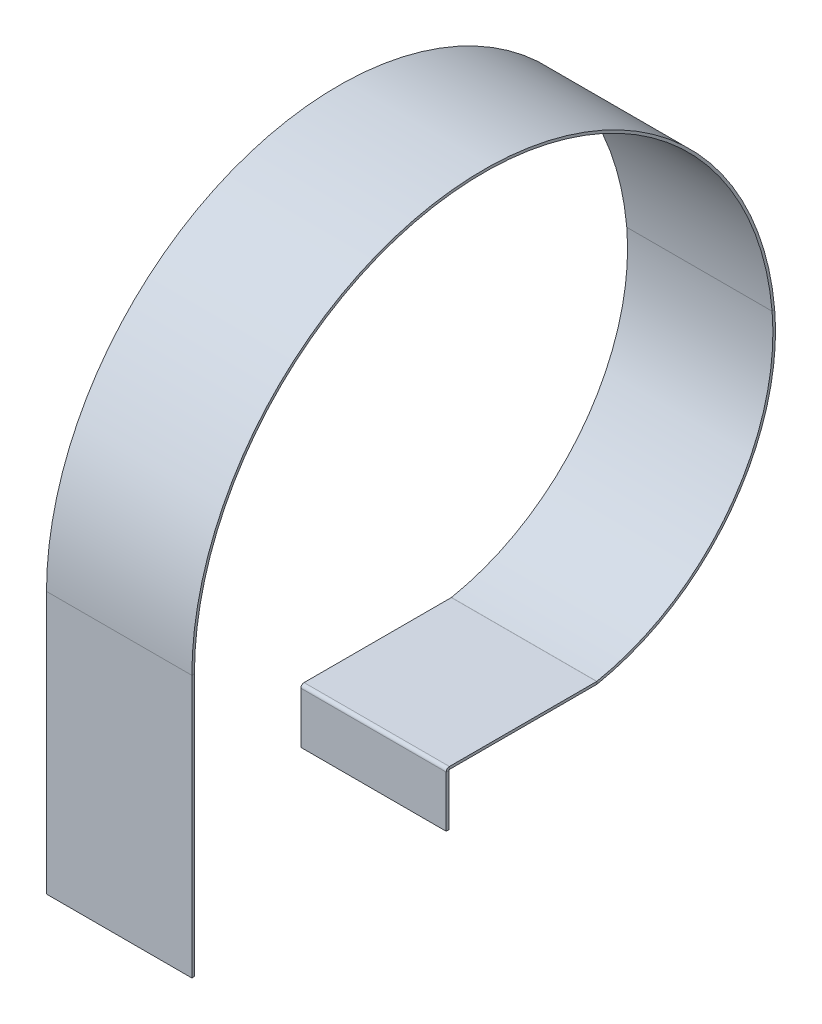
ISO-10303-21;
HEADER;
FILE_DESCRIPTION(('STEP AP214'),'2;1');
FILE_NAME('part.step','',(''),(''),'','','');
FILE_SCHEMA(('AUTOMOTIVE_DESIGN { 1 0 10303 214 1 1 1 1 }'));
ENDSEC;
DATA;
#1=APPLICATION_CONTEXT('core data for automotive mechanical design processes');
#2=APPLICATION_PROTOCOL_DEFINITION('international standard','automotive_design',2000,#1);
#3=PRODUCT_CONTEXT('',#1,'mechanical');
#4=PRODUCT('Part','Part','',(#3));
#5=PRODUCT_RELATED_PRODUCT_CATEGORY('part','',(#4));
#6=PRODUCT_DEFINITION_FORMATION('','',#4);
#7=PRODUCT_DEFINITION_CONTEXT('part definition',#1,'design');
#8=PRODUCT_DEFINITION('design','',#6,#7);
#9=PRODUCT_DEFINITION_SHAPE('','',#8);
#10=(LENGTH_UNIT() NAMED_UNIT(*) SI_UNIT(.MILLI.,.METRE.));
#11=(NAMED_UNIT(*) PLANE_ANGLE_UNIT() SI_UNIT($,.RADIAN.));
#12=(NAMED_UNIT(*) SI_UNIT($,.STERADIAN.) SOLID_ANGLE_UNIT());
#13=UNCERTAINTY_MEASURE_WITH_UNIT(LENGTH_MEASURE(1.E-05),#10,'distance_accuracy_value','');
#14=(GEOMETRIC_REPRESENTATION_CONTEXT(3) GLOBAL_UNCERTAINTY_ASSIGNED_CONTEXT((#13)) GLOBAL_UNIT_ASSIGNED_CONTEXT((#10,
#11,#12)) REPRESENTATION_CONTEXT('',''));
#15=CARTESIAN_POINT('',(0.,0.,0.));
#16=DIRECTION('',(0.,0.,1.));
#17=DIRECTION('',(1.,0.,0.));
#18=AXIS2_PLACEMENT_3D('',#15,#16,#17);
#19=CARTESIAN_POINT('',(112.,41.926268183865,-312.082722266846));
#20=DIRECTION('',(1.,0.,0.));
#21=DIRECTION('',(0.,0.,-1.));
#22=AXIS2_PLACEMENT_3D('',#19,#20,#21);
#23=PLANE('',#22);
#24=DIRECTION('',(0.,0.,1.));
#25=VECTOR('',#24,1.);
#26=CARTESIAN_POINT('',(112.,39.9169446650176,-312.228237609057));
#27=LINE('',#26,#25);
#28=CARTESIAN_POINT('',(112.,39.9169446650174,-311.986615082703));
#29=VERTEX_POINT('',#28);
#30=CARTESIAN_POINT('',(112.,39.9169446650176,-198.498237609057));
#31=VERTEX_POINT('',#30);
#32=EDGE_CURVE('E271',#29,#31,#27,.T.);
#33=ORIENTED_EDGE('',*,*,#32,.F.);
#34=DIRECTION('',(0.,1.,0.));
#35=VECTOR('',#34,1.);
#36=CARTESIAN_POINT('',(112.,39.9169446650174,-311.986615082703));
#37=LINE('',#36,#35);
#38=CARTESIAN_POINT('',(112.,41.9169446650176,-311.986615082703));
#39=VERTEX_POINT('',#38);
#40=EDGE_CURVE('E301',#29,#39,#37,.T.);
#41=ORIENTED_EDGE('',*,*,#40,.T.);
#42=DIRECTION('',(0.,0.,1.));
#43=VECTOR('',#42,1.);
#44=CARTESIAN_POINT('',(112.,41.9169446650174,-312.228237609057));
#45=LINE('',#44,#43);
#46=CARTESIAN_POINT('',(112.,41.9169446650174,-198.498237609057));
#47=VERTEX_POINT('',#46);
#48=EDGE_CURVE('E274',#39,#47,#45,.T.);
#49=ORIENTED_EDGE('',*,*,#48,.T.);
#50=DIRECTION('',(0.,-1.,0.));
#51=VECTOR('',#50,1.);
#52=CARTESIAN_POINT('',(112.,41.9169446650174,-198.498237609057));
#53=LINE('',#52,#51);
#54=EDGE_CURVE('E285',#47,#31,#53,.T.);
#55=ORIENTED_EDGE('',*,*,#54,.T.);
#56=EDGE_LOOP('',(#33,#41,#49,#55));
#57=FACE_BOUND('',#56,.T.);
#58=ADVANCED_FACE('F35',(#57),#23,.T.);
#59=CARTESIAN_POINT('',(0.,39.4169446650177,-195.998237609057));
#60=DIRECTION('',(-1.,0.,0.));
#61=DIRECTION('',(0.,0.,1.));
#62=AXIS2_PLACEMENT_3D('',#59,#60,#61);
#63=PLANE('',#62);
#64=DIRECTION('',(0.,0.,1.));
#65=VECTOR('',#64,1.);
#66=CARTESIAN_POINT('',(0.,39.9169446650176,-312.228237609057));
#67=LINE('',#66,#65);
#68=CARTESIAN_POINT('',(0.,39.9169446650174,-311.986615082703));
#69=VERTEX_POINT('',#68);
#70=CARTESIAN_POINT('',(0.,39.9169446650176,-198.498237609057));
#71=VERTEX_POINT('',#70);
#72=EDGE_CURVE('E266',#69,#71,#67,.T.);
#73=ORIENTED_EDGE('',*,*,#72,.T.);
#74=DIRECTION('',(0.,1.,0.));
#75=VECTOR('',#74,1.);
#76=CARTESIAN_POINT('',(0.,39.9169446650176,-198.498237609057));
#77=LINE('',#76,#75);
#78=CARTESIAN_POINT('',(0.,41.9169446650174,-198.498237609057));
#79=VERTEX_POINT('',#78);
#80=EDGE_CURVE('E290',#71,#79,#77,.T.);
#81=ORIENTED_EDGE('',*,*,#80,.T.);
#82=DIRECTION('',(0.,0.,1.));
#83=VECTOR('',#82,1.);
#84=CARTESIAN_POINT('',(0.,41.9169446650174,-312.228237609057));
#85=LINE('',#84,#83);
#86=CARTESIAN_POINT('',(0.,41.9169446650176,-311.986615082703));
#87=VERTEX_POINT('',#86);
#88=EDGE_CURVE('E275',#87,#79,#85,.T.);
#89=ORIENTED_EDGE('',*,*,#88,.F.);
#90=DIRECTION('',(0.,-1.,0.));
#91=VECTOR('',#90,1.);
#92=CARTESIAN_POINT('',(0.,41.9169446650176,-311.986615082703));
#93=LINE('',#92,#91);
#94=EDGE_CURVE('E296',#87,#69,#93,.T.);
#95=ORIENTED_EDGE('',*,*,#94,.T.);
#96=EDGE_LOOP('',(#73,#81,#89,#95));
#97=FACE_BOUND('',#96,.T.);
#98=ADVANCED_FACE('F348',(#97),#63,.T.);
#99=CARTESIAN_POINT('',(112.,39.9169446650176,-312.228237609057));
#100=DIRECTION('',(0.,-1.,0.));
#101=DIRECTION('',(0.,0.,-1.));
#102=AXIS2_PLACEMENT_3D('',#99,#100,#101);
#103=PLANE('',#102);
#104=ORIENTED_EDGE('',*,*,#72,.F.);
#105=DIRECTION('',(-1.,0.,0.));
#106=VECTOR('',#105,1.);
#107=CARTESIAN_POINT('',(112.,39.9169446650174,-311.986615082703));
#108=LINE('',#107,#106);
#109=EDGE_CURVE('E293',#29,#69,#108,.T.);
#110=ORIENTED_EDGE('',*,*,#109,.F.);
#111=ORIENTED_EDGE('',*,*,#32,.T.);
#112=DIRECTION('',(-1.,0.,0.));
#113=VECTOR('',#112,1.);
#114=CARTESIAN_POINT('',(112.,39.9169446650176,-198.498237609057));
#115=LINE('',#114,#113);
#116=EDGE_CURVE('E278',#31,#71,#115,.T.);
#117=ORIENTED_EDGE('',*,*,#116,.T.);
#118=EDGE_LOOP('',(#104,#110,#111,#117));
#119=FACE_BOUND('',#118,.T.);
#120=ADVANCED_FACE('F353',(#119),#103,.T.);
#121=CARTESIAN_POINT('',(112.,41.9169446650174,-312.228237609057));
#122=DIRECTION('',(0.,-1.,0.));
#123=DIRECTION('',(0.,0.,-1.));
#124=AXIS2_PLACEMENT_3D('',#121,#122,#123);
#125=PLANE('',#124);
#126=ORIENTED_EDGE('',*,*,#88,.T.);
#127=DIRECTION('',(-1.,0.,0.));
#128=VECTOR('',#127,1.);
#129=CARTESIAN_POINT('',(112.,41.9169446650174,-198.498237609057));
#130=LINE('',#129,#128);
#131=EDGE_CURVE('E288',#47,#79,#130,.T.);
#132=ORIENTED_EDGE('',*,*,#131,.F.);
#133=ORIENTED_EDGE('',*,*,#48,.F.);
#134=DIRECTION('',(-1.,0.,0.));
#135=VECTOR('',#134,1.);
#136=CARTESIAN_POINT('',(112.,41.9169446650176,-311.986615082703));
#137=LINE('',#136,#135);
#138=EDGE_CURVE('E298',#39,#87,#137,.T.);
#139=ORIENTED_EDGE('',*,*,#138,.T.);
#140=EDGE_LOOP('',(#126,#132,#133,#139));
#141=FACE_BOUND('',#140,.T.);
#142=ADVANCED_FACE('F378',(#141),#125,.F.);
#143=CARTESIAN_POINT('',(112.,39.4169446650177,-198.498237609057));
#144=DIRECTION('',(-1.,0.,0.));
#145=DIRECTION('',(0.,-1.,0.));
#146=AXIS2_PLACEMENT_3D('',#143,#144,#145);
#147=PLANE('',#146);
#148=ORIENTED_EDGE('',*,*,#54,.F.);
#149=CARTESIAN_POINT('',(112.,39.4169446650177,-198.498237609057));
#150=DIRECTION('',(-1.,0.,0.));
#151=DIRECTION('',(0.,-1.,0.));
#152=AXIS2_PLACEMENT_3D('',#149,#150,#151);
#153=CIRCLE('',#152,2.5);
#154=CARTESIAN_POINT('',(112.,39.4169446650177,-195.998237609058));
#155=VERTEX_POINT('',#154);
#156=EDGE_CURVE('E230',#47,#155,#153,.F.);
#157=ORIENTED_EDGE('',*,*,#156,.T.);
#158=DIRECTION('',(0.,0.,1.));
#159=VECTOR('',#158,1.);
#160=CARTESIAN_POINT('',(112.,39.4169446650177,-197.998237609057));
#161=LINE('',#160,#159);
#162=CARTESIAN_POINT('',(112.,39.4169446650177,-197.998237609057));
#163=VERTEX_POINT('',#162);
#164=EDGE_CURVE('E244',#163,#155,#161,.T.);
#165=ORIENTED_EDGE('',*,*,#164,.F.);
#166=CARTESIAN_POINT('',(112.,39.4169446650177,-198.498237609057));
#167=DIRECTION('',(1.,0.,0.));
#168=DIRECTION('',(0.,1.,0.));
#169=AXIS2_PLACEMENT_3D('',#166,#167,#168);
#170=CIRCLE('',#169,0.499999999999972);
#171=EDGE_CURVE('E259',#31,#163,#170,.T.);
#172=ORIENTED_EDGE('',*,*,#171,.F.);
#173=EDGE_LOOP('',(#148,#157,#165,#172));
#174=FACE_BOUND('',#173,.T.);
#175=ADVANCED_FACE('F401',(#174),#147,.F.);
#176=CARTESIAN_POINT('',(0.,39.4169446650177,-198.498237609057));
#177=DIRECTION('',(1.,0.,0.));
#178=DIRECTION('',(0.,0.,1.));
#179=AXIS2_PLACEMENT_3D('',#176,#177,#178);
#180=PLANE('',#179);
#181=DIRECTION('',(0.,0.,-1.));
#182=VECTOR('',#181,1.);
#183=CARTESIAN_POINT('',(0.,39.4169446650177,-195.998237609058));
#184=LINE('',#183,#182);
#185=CARTESIAN_POINT('',(0.,39.4169446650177,-195.998237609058));
#186=VERTEX_POINT('',#185);
#187=CARTESIAN_POINT('',(0.,39.4169446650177,-197.998237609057));
#188=VERTEX_POINT('',#187);
#189=EDGE_CURVE('E234',#186,#188,#184,.T.);
#190=ORIENTED_EDGE('',*,*,#189,.F.);
#191=CARTESIAN_POINT('',(1.11022302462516E-13,39.4169446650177,-198.498237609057));
#192=DIRECTION('',(-1.,0.,0.));
#193=DIRECTION('',(0.,-1.,0.));
#194=AXIS2_PLACEMENT_3D('',#191,#192,#193);
#195=CIRCLE('',#194,2.5);
#196=EDGE_CURVE('E263',#186,#79,#195,.T.);
#197=ORIENTED_EDGE('',*,*,#196,.T.);
#198=ORIENTED_EDGE('',*,*,#80,.F.);
#199=CARTESIAN_POINT('',(0.,39.4169446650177,-198.498237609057));
#200=DIRECTION('',(-1.,0.,0.));
#201=DIRECTION('',(0.,0.,-1.));
#202=AXIS2_PLACEMENT_3D('',#199,#200,#201);
#203=CIRCLE('',#202,0.499999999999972);
#204=EDGE_CURVE('E262',#188,#71,#203,.T.);
#205=ORIENTED_EDGE('',*,*,#204,.F.);
#206=EDGE_LOOP('',(#190,#197,#198,#205));
#207=FACE_BOUND('',#206,.T.);
#208=ADVANCED_FACE('F387',(#207),#180,.F.);
#209=CARTESIAN_POINT('',(168.042633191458,39.4169446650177,-198.498237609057));
#210=DIRECTION('',(-1.,0.,0.));
#211=DIRECTION('',(0.,-1.,0.));
#212=AXIS2_PLACEMENT_3D('',#209,#210,#211);
#213=CYLINDRICAL_SURFACE('',#212,0.5);
#214=ORIENTED_EDGE('',*,*,#204,.T.);
#215=ORIENTED_EDGE('',*,*,#116,.F.);
#216=ORIENTED_EDGE('',*,*,#171,.T.);
#217=DIRECTION('',(-1.,0.,0.));
#218=VECTOR('',#217,1.);
#219=CARTESIAN_POINT('',(112.,39.4169446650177,-197.998237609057));
#220=LINE('',#219,#218);
#221=EDGE_CURVE('E223',#163,#188,#220,.T.);
#222=ORIENTED_EDGE('',*,*,#221,.T.);
#223=EDGE_LOOP('',(#214,#215,#216,#222));
#224=FACE_BOUND('',#223,.T.);
#225=ADVANCED_FACE('F398',(#224),#213,.F.);
#226=CARTESIAN_POINT('',(168.042633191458,39.4169446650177,-198.498237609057));
#227=DIRECTION('',(-1.,0.,0.));
#228=DIRECTION('',(0.,-1.,0.));
#229=AXIS2_PLACEMENT_3D('',#226,#227,#228);
#230=CYLINDRICAL_SURFACE('',#229,2.5);
#231=ORIENTED_EDGE('',*,*,#196,.F.);
#232=DIRECTION('',(-1.,0.,0.));
#233=VECTOR('',#232,1.);
#234=CARTESIAN_POINT('',(112.,39.4169446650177,-195.998237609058));
#235=LINE('',#234,#233);
#236=EDGE_CURVE('E236',#155,#186,#235,.T.);
#237=ORIENTED_EDGE('',*,*,#236,.F.);
#238=ORIENTED_EDGE('',*,*,#156,.F.);
#239=ORIENTED_EDGE('',*,*,#131,.T.);
#240=EDGE_LOOP('',(#231,#237,#238,#239));
#241=FACE_BOUND('',#240,.T.);
#242=ADVANCED_FACE('F383',(#241),#230,.T.);
#243=CARTESIAN_POINT('',(112.,-0.0830553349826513,-197.998237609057));
#244=DIRECTION('',(0.,-1.,0.));
#245=DIRECTION('',(0.,0.,-1.));
#246=AXIS2_PLACEMENT_3D('',#243,#244,#245);
#247=PLANE('',#246);
#248=DIRECTION('',(0.,0.,1.));
#249=VECTOR('',#248,1.);
#250=CARTESIAN_POINT('',(0.,-0.0830553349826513,-197.998237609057));
#251=LINE('',#250,#249);
#252=CARTESIAN_POINT('',(0.,-0.0830553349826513,-197.998237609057));
#253=VERTEX_POINT('',#252);
#254=CARTESIAN_POINT('',(0.,-0.0830553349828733,-195.998237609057));
#255=VERTEX_POINT('',#254);
#256=EDGE_CURVE('E227',#253,#255,#251,.T.);
#257=ORIENTED_EDGE('',*,*,#256,.F.);
#258=DIRECTION('',(-1.,0.,0.));
#259=VECTOR('',#258,1.);
#260=CARTESIAN_POINT('',(112.,-0.0830553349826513,-197.998237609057));
#261=LINE('',#260,#259);
#262=CARTESIAN_POINT('',(112.,-0.0830553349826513,-197.998237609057));
#263=VERTEX_POINT('',#262);
#264=EDGE_CURVE('E247',#263,#253,#261,.T.);
#265=ORIENTED_EDGE('',*,*,#264,.F.);
#266=DIRECTION('',(0.,0.,1.));
#267=VECTOR('',#266,1.);
#268=CARTESIAN_POINT('',(112.,-0.0830553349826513,-197.998237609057));
#269=LINE('',#268,#267);
#270=CARTESIAN_POINT('',(112.,-0.0830553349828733,-195.998237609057));
#271=VERTEX_POINT('',#270);
#272=EDGE_CURVE('E254',#263,#271,#269,.T.);
#273=ORIENTED_EDGE('',*,*,#272,.T.);
#274=DIRECTION('',(-1.,0.,0.));
#275=VECTOR('',#274,1.);
#276=CARTESIAN_POINT('',(112.,-0.0830553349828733,-195.998237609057));
#277=LINE('',#276,#275);
#278=EDGE_CURVE('E252',#271,#255,#277,.T.);
#279=ORIENTED_EDGE('',*,*,#278,.T.);
#280=EDGE_LOOP('',(#257,#265,#273,#279));
#281=FACE_BOUND('',#280,.T.);
#282=ADVANCED_FACE('F409',(#281),#247,.T.);
#283=CARTESIAN_POINT('',(112.,39.9169446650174,-197.998237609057));
#284=DIRECTION('',(0.,0.,-1.));
#285=DIRECTION('',(-1.,0.,0.));
#286=AXIS2_PLACEMENT_3D('',#283,#284,#285);
#287=PLANE('',#286);
#288=DIRECTION('',(0.,-1.,0.));
#289=VECTOR('',#288,1.);
#290=CARTESIAN_POINT('',(0.,39.9169446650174,-197.998237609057));
#291=LINE('',#290,#289);
#292=EDGE_CURVE('E231',#188,#253,#291,.T.);
#293=ORIENTED_EDGE('',*,*,#292,.F.);
#294=ORIENTED_EDGE('',*,*,#221,.F.);
#295=DIRECTION('',(0.,-1.,0.));
#296=VECTOR('',#295,1.);
#297=CARTESIAN_POINT('',(112.,39.9169446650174,-197.998237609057));
#298=LINE('',#297,#296);
#299=EDGE_CURVE('E249',#163,#263,#298,.T.);
#300=ORIENTED_EDGE('',*,*,#299,.T.);
#301=ORIENTED_EDGE('',*,*,#264,.T.);
#302=EDGE_LOOP('',(#293,#294,#300,#301));
#303=FACE_BOUND('',#302,.T.);
#304=ADVANCED_FACE('F394',(#303),#287,.T.);
#305=CARTESIAN_POINT('',(112.,41.9169446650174,-198.498237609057));
#306=DIRECTION('',(1.,0.,0.));
#307=DIRECTION('',(0.,0.,-1.));
#308=AXIS2_PLACEMENT_3D('',#305,#306,#307);
#309=PLANE('',#308);
#310=ORIENTED_EDGE('',*,*,#299,.F.);
#311=ORIENTED_EDGE('',*,*,#164,.T.);
#312=DIRECTION('',(0.,1.,0.));
#313=VECTOR('',#312,1.);
#314=CARTESIAN_POINT('',(112.,39.9169446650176,-195.998237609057));
#315=LINE('',#314,#313);
#316=EDGE_CURVE('E242',#155,#271,#315,.F.);
#317=ORIENTED_EDGE('',*,*,#316,.T.);
#318=ORIENTED_EDGE('',*,*,#272,.F.);
#319=EDGE_LOOP('',(#310,#311,#317,#318));
#320=FACE_BOUND('',#319,.T.);
#321=ADVANCED_FACE('F403',(#320),#309,.T.);
#322=CARTESIAN_POINT('',(112.,39.9169446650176,-195.998237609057));
#323=DIRECTION('',(0.,0.,-1.));
#324=DIRECTION('',(-1.,0.,0.));
#325=AXIS2_PLACEMENT_3D('',#322,#323,#324);
#326=PLANE('',#325);
#327=DIRECTION('',(0.,1.,0.));
#328=VECTOR('',#327,1.);
#329=CARTESIAN_POINT('',(0.,39.9169446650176,-195.998237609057));
#330=LINE('',#329,#328);
#331=EDGE_CURVE('E239',#186,#255,#330,.F.);
#332=ORIENTED_EDGE('',*,*,#331,.T.);
#333=ORIENTED_EDGE('',*,*,#278,.F.);
#334=ORIENTED_EDGE('',*,*,#316,.F.);
#335=ORIENTED_EDGE('',*,*,#236,.T.);
#336=EDGE_LOOP('',(#332,#333,#334,#335));
#337=FACE_BOUND('',#336,.T.);
#338=ADVANCED_FACE('F407',(#337),#326,.F.);
#339=CARTESIAN_POINT('',(0.,39.4169446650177,-198.498237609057));
#340=DIRECTION('',(-1.,0.,0.));
#341=DIRECTION('',(0.,0.,1.));
#342=AXIS2_PLACEMENT_3D('',#339,#340,#341);
#343=PLANE('',#342);
#344=ORIENTED_EDGE('',*,*,#331,.F.);
#345=ORIENTED_EDGE('',*,*,#189,.T.);
#346=ORIENTED_EDGE('',*,*,#292,.T.);
#347=ORIENTED_EDGE('',*,*,#256,.T.);
#348=EDGE_LOOP('',(#344,#345,#346,#347));
#349=FACE_BOUND('',#348,.T.);
#350=ADVANCED_FACE('F391',(#349),#343,.T.);
#351=CARTESIAN_POINT('',(112.,42.4169446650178,-311.986615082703));
#352=DIRECTION('',(1.,0.,0.));
#353=DIRECTION('',(0.,0.981352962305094,0.192214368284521));
#354=AXIS2_PLACEMENT_3D('',#351,#352,#353);
#355=PLANE('',#354);
#356=DIRECTION('',(0.,-0.981352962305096,-0.19221436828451));
#357=VECTOR('',#356,1.);
#358=CARTESIAN_POINT('',(112.,41.926268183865,-312.082722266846));
#359=LINE('',#358,#357);
#360=CARTESIAN_POINT('',(112.,41.926268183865,-312.082722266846));
#361=VERTEX_POINT('',#360);
#362=CARTESIAN_POINT('',(112.,39.9635622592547,-312.467151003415));
#363=VERTEX_POINT('',#362);
#364=EDGE_CURVE('E312',#361,#363,#359,.T.);
#365=ORIENTED_EDGE('',*,*,#364,.F.);
#366=CARTESIAN_POINT('',(112.,42.4169446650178,-311.986615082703));
#367=DIRECTION('',(-1.,0.,0.));
#368=DIRECTION('',(0.,-0.981352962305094,-0.192214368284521));
#369=AXIS2_PLACEMENT_3D('',#366,#367,#368);
#370=CIRCLE('',#369,0.5);
#371=EDGE_CURVE('E214',#361,#39,#370,.T.);
#372=ORIENTED_EDGE('',*,*,#371,.T.);
#373=ORIENTED_EDGE('',*,*,#40,.F.);
#374=CARTESIAN_POINT('',(112.,42.4169446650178,-311.986615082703));
#375=DIRECTION('',(-1.,0.,0.));
#376=DIRECTION('',(0.,-0.981352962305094,-0.192214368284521));
#377=AXIS2_PLACEMENT_3D('',#374,#375,#376);
#378=CIRCLE('',#377,2.5);
#379=EDGE_CURVE('E216',#363,#29,#378,.T.);
#380=ORIENTED_EDGE('',*,*,#379,.F.);
#381=EDGE_LOOP('',(#365,#372,#373,#380));
#382=FACE_BOUND('',#381,.T.);
#383=ADVANCED_FACE('F361',(#382),#355,.T.);
#384=CARTESIAN_POINT('',(0.,42.4169446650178,-311.986615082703));
#385=DIRECTION('',(-1.,0.,0.));
#386=DIRECTION('',(0.,-0.981352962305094,-0.192214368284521));
#387=AXIS2_PLACEMENT_3D('',#384,#385,#386);
#388=PLANE('',#387);
#389=ORIENTED_EDGE('',*,*,#94,.F.);
#390=CARTESIAN_POINT('',(0.,42.4169446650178,-311.986615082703));
#391=DIRECTION('',(-1.,0.,0.));
#392=DIRECTION('',(0.,-0.981352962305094,-0.192214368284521));
#393=AXIS2_PLACEMENT_3D('',#390,#391,#392);
#394=CIRCLE('',#393,0.5);
#395=CARTESIAN_POINT('',(0.,41.926268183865,-312.082722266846));
#396=VERTEX_POINT('',#395);
#397=EDGE_CURVE('E220',#87,#396,#394,.F.);
#398=ORIENTED_EDGE('',*,*,#397,.T.);
#399=DIRECTION('',(0.,0.981352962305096,0.19221436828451));
#400=VECTOR('',#399,1.);
#401=CARTESIAN_POINT('',(0.,39.9635622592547,-312.467151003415));
#402=LINE('',#401,#400);
#403=CARTESIAN_POINT('',(0.,39.9635622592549,-312.467151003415));
#404=VERTEX_POINT('',#403);
#405=EDGE_CURVE('E307',#404,#396,#402,.T.);
#406=ORIENTED_EDGE('',*,*,#405,.F.);
#407=CARTESIAN_POINT('',(0.,42.4169446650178,-311.986615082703));
#408=DIRECTION('',(1.,0.,0.));
#409=DIRECTION('',(0.,0.981352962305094,0.192214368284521));
#410=AXIS2_PLACEMENT_3D('',#407,#408,#409);
#411=CIRCLE('',#410,2.5);
#412=EDGE_CURVE('E219',#69,#404,#411,.T.);
#413=ORIENTED_EDGE('',*,*,#412,.F.);
#414=EDGE_LOOP('',(#389,#398,#406,#413));
#415=FACE_BOUND('',#414,.T.);
#416=ADVANCED_FACE('F373',(#415),#388,.T.);
#417=CARTESIAN_POINT('',(168.018231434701,42.4169446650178,-311.986615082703));
#418=DIRECTION('',(-1.,0.,0.));
#419=DIRECTION('',(0.,-0.981352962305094,-0.192214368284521));
#420=AXIS2_PLACEMENT_3D('',#417,#418,#419);
#421=CYLINDRICAL_SURFACE('',#420,2.5);
#422=ORIENTED_EDGE('',*,*,#412,.T.);
#423=DIRECTION('',(-1.,0.,0.));
#424=VECTOR('',#423,1.);
#425=CARTESIAN_POINT('',(112.,39.9635622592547,-312.467151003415));
#426=LINE('',#425,#424);
#427=EDGE_CURVE('E304',#363,#404,#426,.T.);
#428=ORIENTED_EDGE('',*,*,#427,.F.);
#429=ORIENTED_EDGE('',*,*,#379,.T.);
#430=ORIENTED_EDGE('',*,*,#109,.T.);
#431=EDGE_LOOP('',(#422,#428,#429,#430));
#432=FACE_BOUND('',#431,.T.);
#433=ADVANCED_FACE('F364',(#432),#421,.T.);
#434=CARTESIAN_POINT('',(168.018231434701,42.4169446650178,-311.986615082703));
#435=DIRECTION('',(-1.,0.,0.));
#436=DIRECTION('',(0.,-0.981352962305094,-0.192214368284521));
#437=AXIS2_PLACEMENT_3D('',#434,#435,#436);
#438=CYLINDRICAL_SURFACE('',#437,0.5);
#439=ORIENTED_EDGE('',*,*,#397,.F.);
#440=ORIENTED_EDGE('',*,*,#138,.F.);
#441=ORIENTED_EDGE('',*,*,#371,.F.);
#442=DIRECTION('',(-1.,0.,0.));
#443=VECTOR('',#442,1.);
#444=CARTESIAN_POINT('',(112.,41.926268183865,-312.082722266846));
#445=LINE('',#444,#443);
#446=EDGE_CURVE('E309',#361,#396,#445,.T.);
#447=ORIENTED_EDGE('',*,*,#446,.T.);
#448=EDGE_LOOP('',(#439,#440,#441,#447));
#449=FACE_BOUND('',#448,.T.);
#450=ADVANCED_FACE('F376',(#449),#438,.F.);
#451=CARTESIAN_POINT('',(112.,206.793565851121,-279.790708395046));
#452=DIRECTION('',(1.,0.,0.));
#453=DIRECTION('',(0.,-0.0871557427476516,0.996194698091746));
#454=AXIS2_PLACEMENT_3D('',#451,#452,#453);
#455=PLANE('',#454);
#456=DIRECTION('',(0.,0.0871557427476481,-0.996194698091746));
#457=VECTOR('',#456,1.);
#458=CARTESIAN_POINT('',(112.,221.435730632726,-447.15141767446));
#459=LINE('',#458,#457);
#460=CARTESIAN_POINT('',(112.,221.435730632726,-447.15141767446));
#461=VERTEX_POINT('',#460);
#462=CARTESIAN_POINT('',(112.,221.610042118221,-449.143807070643));
#463=VERTEX_POINT('',#462);
#464=EDGE_CURVE('E11',#461,#463,#459,.T.);
#465=ORIENTED_EDGE('',*,*,#464,.F.);
#466=CARTESIAN_POINT('',(112.,206.793565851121,-279.790708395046));
#467=DIRECTION('',(-1.,0.,0.));
#468=DIRECTION('',(0.,0.0871557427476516,-0.996194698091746));
#469=AXIS2_PLACEMENT_3D('',#466,#467,#468);
#470=CIRCLE('',#469,168.);
#471=EDGE_CURVE('E49',#461,#361,#470,.T.);
#472=ORIENTED_EDGE('',*,*,#471,.T.);
#473=ORIENTED_EDGE('',*,*,#364,.T.);
#474=CARTESIAN_POINT('',(112.,206.793565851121,-279.790708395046));
#475=DIRECTION('',(-1.,0.,0.));
#476=DIRECTION('',(0.,0.0871557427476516,-0.996194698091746));
#477=AXIS2_PLACEMENT_3D('',#474,#475,#476);
#478=CIRCLE('',#477,170.);
#479=EDGE_CURVE('E208',#463,#363,#478,.T.);
#480=ORIENTED_EDGE('',*,*,#479,.F.);
#481=EDGE_LOOP('',(#465,#472,#473,#480));
#482=FACE_BOUND('',#481,.T.);
#483=ADVANCED_FACE('F368',(#482),#455,.T.);
#484=CARTESIAN_POINT('',(0.,206.793565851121,-279.790708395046));
#485=DIRECTION('',(-1.,0.,0.));
#486=DIRECTION('',(0.,0.0871557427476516,-0.996194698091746));
#487=AXIS2_PLACEMENT_3D('',#484,#485,#486);
#488=PLANE('',#487);
#489=ORIENTED_EDGE('',*,*,#405,.T.);
#490=CARTESIAN_POINT('',(0.,206.793565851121,-279.790708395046));
#491=DIRECTION('',(-1.,0.,0.));
#492=DIRECTION('',(0.,0.0871557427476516,-0.996194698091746));
#493=AXIS2_PLACEMENT_3D('',#490,#491,#492);
#494=CIRCLE('',#493,168.);
#495=CARTESIAN_POINT('',(0.,221.435730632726,-447.15141767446));
#496=VERTEX_POINT('',#495);
#497=EDGE_CURVE('E57',#396,#496,#494,.F.);
#498=ORIENTED_EDGE('',*,*,#497,.T.);
#499=DIRECTION('',(0.,-0.0871557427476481,0.996194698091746));
#500=VECTOR('',#499,1.);
#501=CARTESIAN_POINT('',(0.,221.610042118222,-449.143807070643));
#502=LINE('',#501,#500);
#503=CARTESIAN_POINT('',(2.4980018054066E-13,221.610042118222,-449.143807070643));
#504=VERTEX_POINT('',#503);
#505=EDGE_CURVE('E317',#504,#496,#502,.T.);
#506=ORIENTED_EDGE('',*,*,#505,.F.);
#507=CARTESIAN_POINT('',(0.,206.793565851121,-279.790708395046));
#508=DIRECTION('',(1.,0.,0.));
#509=DIRECTION('',(0.,-0.0871557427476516,0.996194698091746));
#510=AXIS2_PLACEMENT_3D('',#507,#508,#509);
#511=CIRCLE('',#510,170.);
#512=EDGE_CURVE('E211',#404,#504,#511,.T.);
#513=ORIENTED_EDGE('',*,*,#512,.F.);
#514=EDGE_LOOP('',(#489,#498,#506,#513));
#515=FACE_BOUND('',#514,.T.);
#516=ADVANCED_FACE('F370',(#515),#488,.T.);
#517=CARTESIAN_POINT('',(327.692109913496,206.793565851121,-279.790708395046));
#518=DIRECTION('',(-1.,0.,0.));
#519=DIRECTION('',(0.,0.0871557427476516,-0.996194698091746));
#520=AXIS2_PLACEMENT_3D('',#517,#518,#519);
#521=CYLINDRICAL_SURFACE('',#520,170.);
#522=ORIENTED_EDGE('',*,*,#512,.T.);
#523=DIRECTION('',(-1.,0.,0.));
#524=VECTOR('',#523,1.);
#525=CARTESIAN_POINT('',(112.,221.610042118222,-449.143807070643));
#526=LINE('',#525,#524);
#527=EDGE_CURVE('E315',#463,#504,#526,.T.);
#528=ORIENTED_EDGE('',*,*,#527,.F.);
#529=ORIENTED_EDGE('',*,*,#479,.T.);
#530=ORIENTED_EDGE('',*,*,#427,.T.);
#531=EDGE_LOOP('',(#522,#528,#529,#530));
#532=FACE_BOUND('',#531,.T.);
#533=ADVANCED_FACE('F344',(#532),#521,.T.);
#534=CARTESIAN_POINT('',(327.692109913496,206.793565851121,-279.790708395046));
#535=DIRECTION('',(-1.,0.,0.));
#536=DIRECTION('',(0.,0.0871557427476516,-0.996194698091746));
#537=AXIS2_PLACEMENT_3D('',#534,#535,#536);
#538=CYLINDRICAL_SURFACE('',#537,168.);
#539=ORIENTED_EDGE('',*,*,#497,.F.);
#540=ORIENTED_EDGE('',*,*,#446,.F.);
#541=ORIENTED_EDGE('',*,*,#471,.F.);
#542=DIRECTION('',(-1.,0.,0.));
#543=VECTOR('',#542,1.);
#544=CARTESIAN_POINT('',(112.,221.435730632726,-447.15141767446));
#545=LINE('',#544,#543);
#546=EDGE_CURVE('E42',#461,#496,#545,.T.);
#547=ORIENTED_EDGE('',*,*,#546,.T.);
#548=EDGE_LOOP('',(#539,#540,#541,#547));
#549=FACE_BOUND('',#548,.T.);
#550=ADVANCED_FACE('F320',(#549),#538,.F.);
#551=CARTESIAN_POINT('',(112.,0.,-2.));
#552=DIRECTION('',(0.,-1.,0.));
#553=DIRECTION('',(0.,0.,-1.));
#554=AXIS2_PLACEMENT_3D('',#551,#552,#553);
#555=PLANE('',#554);
#556=DIRECTION('',(0.,0.,1.));
#557=VECTOR('',#556,1.);
#558=CARTESIAN_POINT('',(0.,0.,-2.));
#559=LINE('',#558,#557);
#560=CARTESIAN_POINT('',(0.,0.,-2.));
#561=VERTEX_POINT('',#560);
#562=CARTESIAN_POINT('',(0.,0.,0.));
#563=VERTEX_POINT('',#562);
#564=EDGE_CURVE('E196',#561,#563,#559,.T.);
#565=ORIENTED_EDGE('',*,*,#564,.F.);
#566=DIRECTION('',(-1.,0.,0.));
#567=VECTOR('',#566,1.);
#568=CARTESIAN_POINT('',(112.,0.,-2.));
#569=LINE('',#568,#567);
#570=CARTESIAN_POINT('',(112.,0.,-2.));
#571=VERTEX_POINT('',#570);
#572=EDGE_CURVE('E186',#571,#561,#569,.T.);
#573=ORIENTED_EDGE('',*,*,#572,.F.);
#574=DIRECTION('',(0.,0.,1.));
#575=VECTOR('',#574,1.);
#576=CARTESIAN_POINT('',(112.,0.,-2.));
#577=LINE('',#576,#575);
#578=CARTESIAN_POINT('',(112.,0.,0.));
#579=VERTEX_POINT('',#578);
#580=EDGE_CURVE('E204',#571,#579,#577,.T.);
#581=ORIENTED_EDGE('',*,*,#580,.T.);
#582=DIRECTION('',(-1.,0.,0.));
#583=VECTOR('',#582,1.);
#584=CARTESIAN_POINT('',(112.,0.,0.));
#585=LINE('',#584,#583);
#586=EDGE_CURVE('E174',#579,#563,#585,.T.);
#587=ORIENTED_EDGE('',*,*,#586,.T.);
#588=EDGE_LOOP('',(#565,#573,#581,#587));
#589=FACE_BOUND('',#588,.T.);
#590=ADVANCED_FACE('F336',(#589),#555,.T.);
#591=CARTESIAN_POINT('',(112.,0.,0.));
#592=DIRECTION('',(0.,0.,1.));
#593=DIRECTION('',(1.,0.,0.));
#594=AXIS2_PLACEMENT_3D('',#591,#592,#593);
#595=PLANE('',#594);
#596=DIRECTION('',(0.,1.,0.));
#597=VECTOR('',#596,1.);
#598=CARTESIAN_POINT('',(0.,0.,0.));
#599=LINE('',#598,#597);
#600=CARTESIAN_POINT('',(2.22044604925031E-13,202.,0.));
#601=VERTEX_POINT('',#600);
#602=EDGE_CURVE('E169',#563,#601,#599,.T.);
#603=ORIENTED_EDGE('',*,*,#602,.F.);
#604=ORIENTED_EDGE('',*,*,#586,.F.);
#605=DIRECTION('',(0.,1.,0.));
#606=VECTOR('',#605,1.);
#607=CARTESIAN_POINT('',(112.,0.,0.));
#608=LINE('',#607,#606);
#609=CARTESIAN_POINT('',(112.,202.,0.));
#610=VERTEX_POINT('',#609);
#611=EDGE_CURVE('E170',#579,#610,#608,.T.);
#612=ORIENTED_EDGE('',*,*,#611,.T.);
#613=DIRECTION('',(-1.,0.,0.));
#614=VECTOR('',#613,1.);
#615=CARTESIAN_POINT('',(112.,202.,0.));
#616=LINE('',#615,#614);
#617=EDGE_CURVE('E162',#610,#601,#616,.T.);
#618=ORIENTED_EDGE('',*,*,#617,.T.);
#619=EDGE_LOOP('',(#603,#604,#612,#618));
#620=FACE_BOUND('',#619,.T.);
#621=ADVANCED_FACE('F173',(#620),#595,.T.);
#622=CARTESIAN_POINT('',(0.,41.9169446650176,-311.986615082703));
#623=DIRECTION('',(-1.,0.,0.));
#624=DIRECTION('',(0.,0.,1.));
#625=AXIS2_PLACEMENT_3D('',#622,#623,#624);
#626=PLANE('',#625);
#627=ORIENTED_EDGE('',*,*,#602,.T.);
#628=DIRECTION('',(0.,0.,-1.));
#629=VECTOR('',#628,1.);
#630=CARTESIAN_POINT('',(0.,202.,0.));
#631=LINE('',#630,#629);
#632=CARTESIAN_POINT('',(0.,202.,-2.));
#633=VERTEX_POINT('',#632);
#634=EDGE_CURVE('E199',#601,#633,#631,.T.);
#635=ORIENTED_EDGE('',*,*,#634,.T.);
#636=DIRECTION('',(0.,1.,0.));
#637=VECTOR('',#636,1.);
#638=CARTESIAN_POINT('',(0.,0.,-2.));
#639=LINE('',#638,#637);
#640=EDGE_CURVE('E193',#561,#633,#639,.T.);
#641=ORIENTED_EDGE('',*,*,#640,.F.);
#642=ORIENTED_EDGE('',*,*,#564,.T.);
#643=EDGE_LOOP('',(#627,#635,#641,#642));
#644=FACE_BOUND('',#643,.T.);
#645=ADVANCED_FACE('F334',(#644),#626,.T.);
#646=CARTESIAN_POINT('',(112.,0.,-2.));
#647=DIRECTION('',(0.,0.,1.));
#648=DIRECTION('',(1.,0.,0.));
#649=AXIS2_PLACEMENT_3D('',#646,#647,#648);
#650=PLANE('',#649);
#651=ORIENTED_EDGE('',*,*,#640,.T.);
#652=DIRECTION('',(-1.,0.,0.));
#653=VECTOR('',#652,1.);
#654=CARTESIAN_POINT('',(112.,202.,-2.));
#655=LINE('',#654,#653);
#656=CARTESIAN_POINT('',(112.,202.,-2.));
#657=VERTEX_POINT('',#656);
#658=EDGE_CURVE('E206',#657,#633,#655,.T.);
#659=ORIENTED_EDGE('',*,*,#658,.F.);
#660=DIRECTION('',(0.,1.,0.));
#661=VECTOR('',#660,1.);
#662=CARTESIAN_POINT('',(112.,0.,-2.));
#663=LINE('',#662,#661);
#664=EDGE_CURVE('E182',#571,#657,#663,.T.);
#665=ORIENTED_EDGE('',*,*,#664,.F.);
#666=ORIENTED_EDGE('',*,*,#572,.T.);
#667=EDGE_LOOP('',(#651,#659,#665,#666));
#668=FACE_BOUND('',#667,.T.);
#669=ADVANCED_FACE('F330',(#668),#650,.F.);
#670=CARTESIAN_POINT('',(112.,39.4169446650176,-198.498237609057));
#671=DIRECTION('',(-1.,0.,0.));
#672=DIRECTION('',(0.,0.,1.));
#673=AXIS2_PLACEMENT_3D('',#670,#671,#672);
#674=PLANE('',#673);
#675=ORIENTED_EDGE('',*,*,#664,.T.);
#676=DIRECTION('',(0.,0.,1.));
#677=VECTOR('',#676,1.);
#678=CARTESIAN_POINT('',(112.,202.,-2.));
#679=LINE('',#678,#677);
#680=EDGE_CURVE('E153',#657,#610,#679,.T.);
#681=ORIENTED_EDGE('',*,*,#680,.T.);
#682=ORIENTED_EDGE('',*,*,#611,.F.);
#683=ORIENTED_EDGE('',*,*,#580,.F.);
#684=EDGE_LOOP('',(#675,#681,#682,#683));
#685=FACE_BOUND('',#684,.T.);
#686=ADVANCED_FACE('F180',(#685),#674,.F.);
#687=CARTESIAN_POINT('',(112.,202.,-225.));
#688=DIRECTION('',(1.,0.,0.));
#689=DIRECTION('',(0.,0.,-1.));
#690=AXIS2_PLACEMENT_3D('',#687,#688,#689);
#691=PLANE('',#690);
#692=ORIENTED_EDGE('',*,*,#680,.F.);
#693=CARTESIAN_POINT('',(112.,202.,-225.));
#694=DIRECTION('',(-1.,0.,0.));
#695=DIRECTION('',(0.,0.,1.));
#696=AXIS2_PLACEMENT_3D('',#693,#694,#695);
#697=CIRCLE('',#696,223.);
#698=EDGE_CURVE('E189',#657,#461,#697,.T.);
#699=ORIENTED_EDGE('',*,*,#698,.T.);
#700=ORIENTED_EDGE('',*,*,#464,.T.);
#701=CARTESIAN_POINT('',(112.,202.,-225.));
#702=DIRECTION('',(-1.,0.,0.));
#703=DIRECTION('',(0.,0.,1.));
#704=AXIS2_PLACEMENT_3D('',#701,#702,#703);
#705=CIRCLE('',#704,225.);
#706=EDGE_CURVE('E148',#610,#463,#705,.T.);
#707=ORIENTED_EDGE('',*,*,#706,.F.);
#708=EDGE_LOOP('',(#692,#699,#700,#707));
#709=FACE_BOUND('',#708,.T.);
#710=ADVANCED_FACE('F150',(#709),#691,.T.);
#711=CARTESIAN_POINT('',(2.22044604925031E-13,202.,-225.));
#712=DIRECTION('',(-1.,0.,0.));
#713=DIRECTION('',(0.,0.,1.));
#714=AXIS2_PLACEMENT_3D('',#711,#712,#713);
#715=PLANE('',#714);
#716=ORIENTED_EDGE('',*,*,#505,.T.);
#717=CARTESIAN_POINT('',(4.44089209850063E-13,202.,-225.));
#718=DIRECTION('',(-1.,0.,0.));
#719=DIRECTION('',(0.,0.,1.));
#720=AXIS2_PLACEMENT_3D('',#717,#718,#719);
#721=CIRCLE('',#720,223.);
#722=EDGE_CURVE('E158',#496,#633,#721,.F.);
#723=ORIENTED_EDGE('',*,*,#722,.T.);
#724=ORIENTED_EDGE('',*,*,#634,.F.);
#725=CARTESIAN_POINT('',(2.22044604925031E-13,202.,-225.));
#726=DIRECTION('',(1.,0.,0.));
#727=DIRECTION('',(0.,0.,-1.));
#728=AXIS2_PLACEMENT_3D('',#725,#726,#727);
#729=CIRCLE('',#728,225.);
#730=EDGE_CURVE('E157',#504,#601,#729,.T.);
#731=ORIENTED_EDGE('',*,*,#730,.F.);
#732=EDGE_LOOP('',(#716,#723,#724,#731));
#733=FACE_BOUND('',#732,.T.);
#734=ADVANCED_FACE('F325',(#733),#715,.T.);
#735=CARTESIAN_POINT('',(749.278668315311,202.,-225.));
#736=DIRECTION('',(-1.,0.,0.));
#737=DIRECTION('',(0.,0.,1.));
#738=AXIS2_PLACEMENT_3D('',#735,#736,#737);
#739=CYLINDRICAL_SURFACE('',#738,225.);
#740=ORIENTED_EDGE('',*,*,#730,.T.);
#741=ORIENTED_EDGE('',*,*,#617,.F.);
#742=ORIENTED_EDGE('',*,*,#706,.T.);
#743=ORIENTED_EDGE('',*,*,#527,.T.);
#744=EDGE_LOOP('',(#740,#741,#742,#743));
#745=FACE_BOUND('',#744,.T.);
#746=ADVANCED_FACE('F164',(#745),#739,.T.);
#747=CARTESIAN_POINT('',(749.278668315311,202.,-225.));
#748=DIRECTION('',(-1.,0.,0.));
#749=DIRECTION('',(0.,0.,1.));
#750=AXIS2_PLACEMENT_3D('',#747,#748,#749);
#751=CYLINDRICAL_SURFACE('',#750,223.);
#752=ORIENTED_EDGE('',*,*,#722,.F.);
#753=ORIENTED_EDGE('',*,*,#546,.F.);
#754=ORIENTED_EDGE('',*,*,#698,.F.);
#755=ORIENTED_EDGE('',*,*,#658,.T.);
#756=EDGE_LOOP('',(#752,#753,#754,#755));
#757=FACE_BOUND('',#756,.T.);
#758=ADVANCED_FACE('F327',(#757),#751,.F.);
#759=CLOSED_SHELL('',(#58,#98,#120,#142,#175,#208,#225,#242,#282,#304,#321,#338,#350,#383,#416,
#433,#450,#483,#516,#533,#550,#590,#621,#645,#669,#686,#710,#734,#746,#758));
#760=MANIFOLD_SOLID_BREP('B2',#759);
#761=ADVANCED_BREP_SHAPE_REPRESENTATION('',(#18,#760),#14);
#762=SHAPE_DEFINITION_REPRESENTATION(#9,#761);
ENDSEC;
END-ISO-10303-21;
